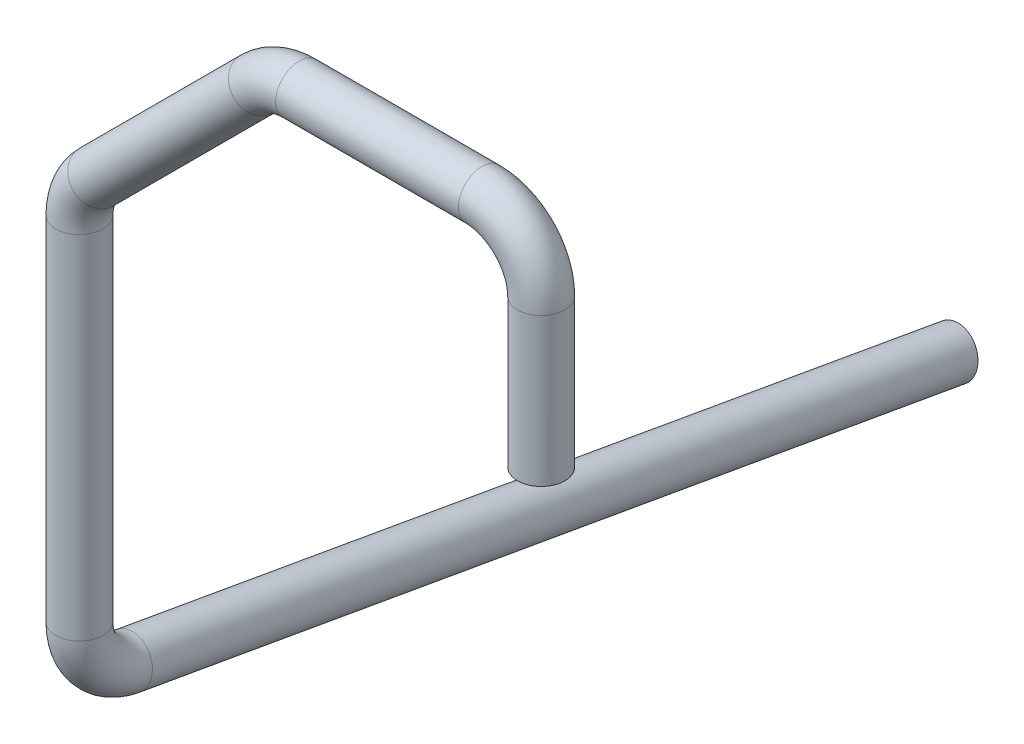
from build123d import *

# Parameters (mm, degrees)
SKETCH7_R   = 4
SKETCH7_R_2 = 3.5


with BuildPart() as part:
    # Sweep4: sweep along a curve in space
    with BuildLine() as sweep4_path:
        Line((0, 0, 0), (0, 25, 0))
        ThreePointArc((0, 25, 0), (-2.928932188, 32.071067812, 0), (-10, 35, 0))
        Line((-10, 35, 0), (-40.857864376, 35, 0))
        ThreePointArc((-40.857864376, 35, 0), (-44.6846987, 34.238795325, 0), (-47.928932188, 32.071067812, 0))
        Line((-47.928932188, 32.071067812, 0), (-75.071067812, 4.928932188, 0))
        ThreePointArc((-75.071067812, 4.928932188, 0), (-77.238795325, 1.6846987, 0), (-78, -2.142135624, 0))
        Line((-78, -2.142135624, 0), (-78, -61.609003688, 0))
        ThreePointArc((-78, -61.609003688, 0), (-78, -68.036879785, -2.339555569), (-78, -71.457081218, -8.263518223))
        Line((-78, -71.457081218, -8.263518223), (-78, -96.04722665, -147.721162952))
    # Sketch7 → Sweep4 (sweep)
    with BuildSketch(Plane(origin=(0, 0, 0), x_dir=(1, 0, 0), z_dir=(0, 1, 0))):
        Circle(SKETCH7_R)
        Circle(SKETCH7_R_2, mode=Mode.SUBTRACT)
    sweep(path=sweep4_path.line)


solid = part.part
